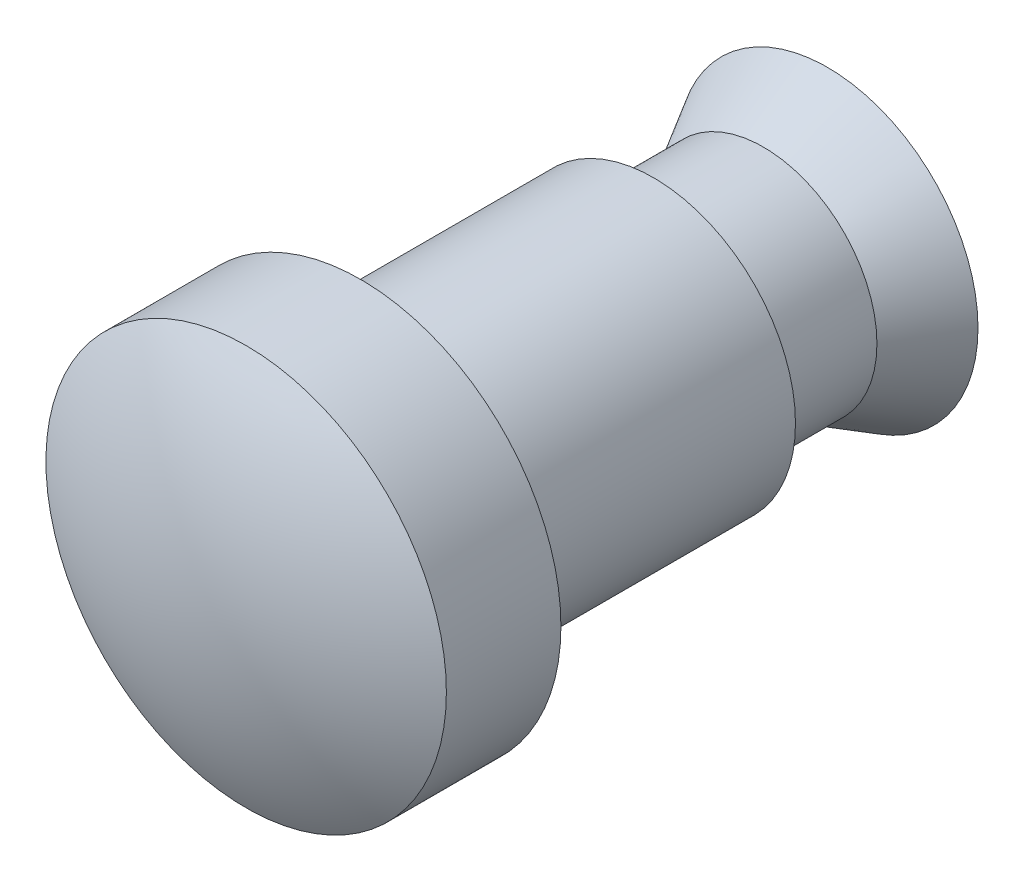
from build123d import *


with BuildPart() as part:
    # Sketch 1 → Revolve 1 (revolve)
    with BuildSketch(Plane(origin=(0, 0, 0), x_dir=(0, 0, -1), z_dir=(1, 0, 0)), mode=Mode.PRIVATE) as revolve_1_sk:
        with BuildLine():
            Line((0, 0), (8.810625, 0))
            Line((8.810625, 0), (8.810625, 2.088064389))
            Line((8.810625, 2.088064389), (7.921625, 1.5748))
            Line((7.921625, 1.5748), (6.397625, 1.5748))
            Line((6.397625, 1.5748), (6.397625, 1.9685))
            Line((6.397625, 1.9685), (2.333625, 1.9685))
            Line((2.333625, 1.9685), (2.333625, 2.778125))
            Line((2.333625, 2.778125), (0.74439635, 2.778125))
            ThreePointArc((0.74439635, 2.778125), (0.189324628, 1.438063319), (0, 0))
        make_face()
    revolve(revolve_1_sk.sketch.rotate(Axis((0, 0, 0), (0, 0, -1)), 90), axis=Axis((0, 0, 0), (0, 0, -1)))


solid = part.part
